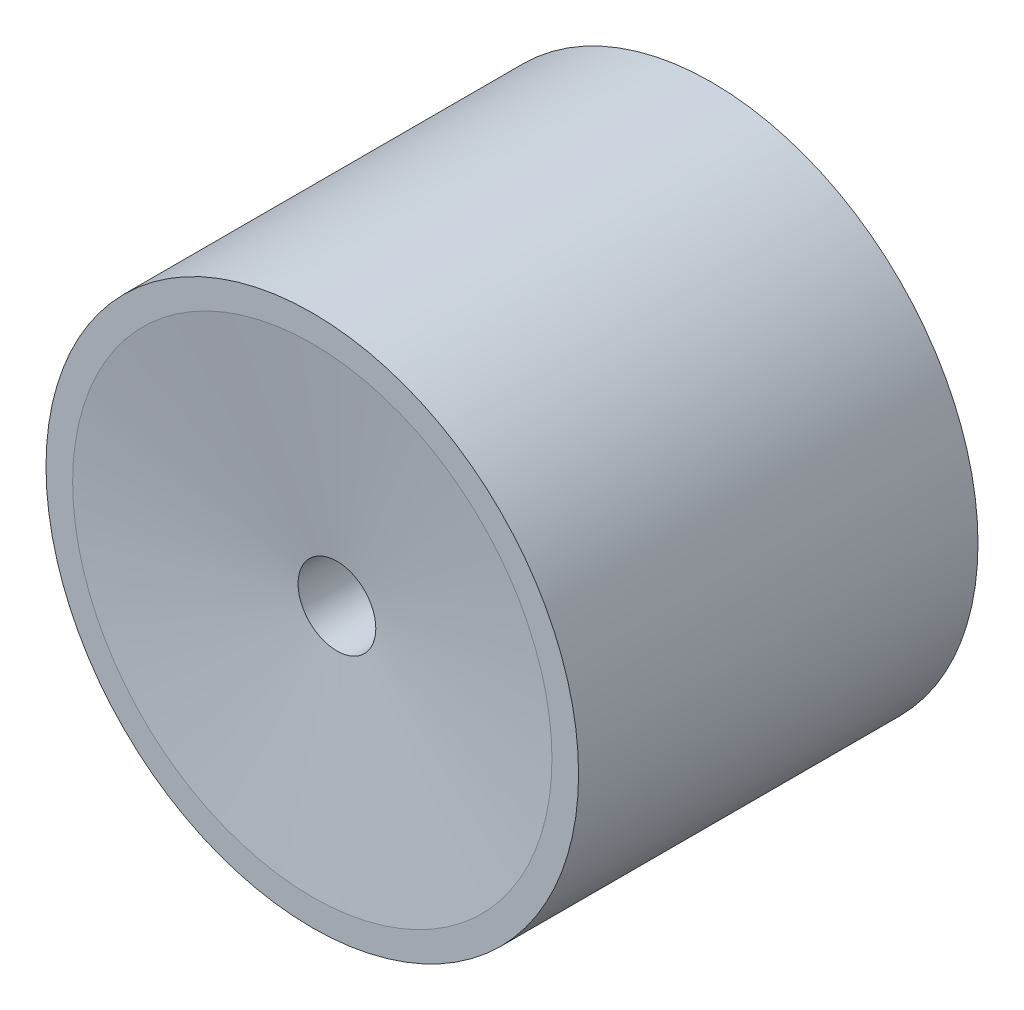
from build123d import *

# Parameters (mm, degrees)
ESQUISSE1_R             = 10
BOSS_EXTRU_1_DEPTH      = 15
ESQUISSE2_R             = 3.4
ENL_V_MAT_EXTRU_1_DEPTH = 8
ESQUISSE3_R             = 1.2
ENL_V_MAT_EXTRU_2_DEPTH = 17.248076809
ENL_V_MAT_EXTRU_2_DRAFT = 2.45
ESQUISSE5_R             = 9
ENL_V_MAT_EXTRU_3_DEPTH = 1
ENL_V_MAT_EXTRU_3_DRAFT = -83
ESQUISSE6_R             = 9
ESQUISSE6_R_2           = 5.5
ENL_V_MAT_EXTRU_4_DEPTH = 13


with BuildPart() as part:
    # Esquisse1 → Boss.-Extru.1 (new body)
    with BuildSketch(Plane.XY):
        Circle(ESQUISSE1_R)
    extrude(amount=BOSS_EXTRU_1_DEPTH)

    # Esquisse2 → Enl_v. mat.-Extru.1 (cut)
    with BuildSketch(Plane.XY):
        Circle(ESQUISSE2_R)
    extrude(amount=ENL_V_MAT_EXTRU_1_DEPTH, mode=Mode.SUBTRACT)


with BuildPart() as enl_v_mat_extru_2_tool:
    # Esquisse3 → Enl_v. mat.-Extru.2 (with draft: the straight prism first)
    with BuildSketch(Plane(origin=(0, 0, 8), x_dir=(-1, 0, 0), z_dir=(0, 0, -1))):
        Circle(ESQUISSE3_R)
    extrude(amount=-ENL_V_MAT_EXTRU_2_DEPTH)
    # Enl_v. mat.-Extru.2: the draft: its side faces are tilted about the plane it starts from
    enl_v_mat_extru_2_sides = [enl_v_mat_extru_2_tool.faces().sort_by_distance(p)[0] for p in [
        (1.2, 0, 16.624038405),
    ]]
    draft(enl_v_mat_extru_2_sides, Plane(origin=(0, 0, 8), x_dir=(-1, 0, 0), z_dir=(0, 0, -1)), ENL_V_MAT_EXTRU_2_DRAFT)


with BuildPart() as part_1:
    add(part.part)

    # Enl_v. mat.-Extru.2: cut by enl_v_mat_extru_2_tool
    add(enl_v_mat_extru_2_tool.part, mode=Mode.SUBTRACT)


with BuildPart() as enl_v_mat_extru_3_tool:
    # Esquisse5 → Enl_v. mat.-Extru.3 (with draft: the straight prism first)
    with BuildSketch(Plane.XY.offset(15)):
        Circle(ESQUISSE5_R)
    extrude(amount=-ENL_V_MAT_EXTRU_3_DEPTH)
    # Enl_v. mat.-Extru.3: the draft: its side faces are tilted about the plane it starts from
    enl_v_mat_extru_3_sides = [enl_v_mat_extru_3_tool.faces().sort_by_distance(p)[0] for p in [
        (-9, 0, 14.5),
    ]]
    draft(enl_v_mat_extru_3_sides, Plane.XY.offset(15), ENL_V_MAT_EXTRU_3_DRAFT)


with BuildPart() as part_2:
    add(part_1.part)

    # Enl_v. mat.-Extru.3: cut by enl_v_mat_extru_3_tool
    add(enl_v_mat_extru_3_tool.part, mode=Mode.SUBTRACT)

    # Esquisse6 → Enl_v. mat.-Extru.4 (cut)
    with BuildSketch(Plane(origin=(0, 0, 0), x_dir=(-1, 0, 0), z_dir=(0, 0, -1))):
        Circle(ESQUISSE6_R)
        Circle(ESQUISSE6_R_2, mode=Mode.SUBTRACT)
    extrude(amount=-ENL_V_MAT_EXTRU_4_DEPTH, mode=Mode.SUBTRACT)


solid = part_2.part
